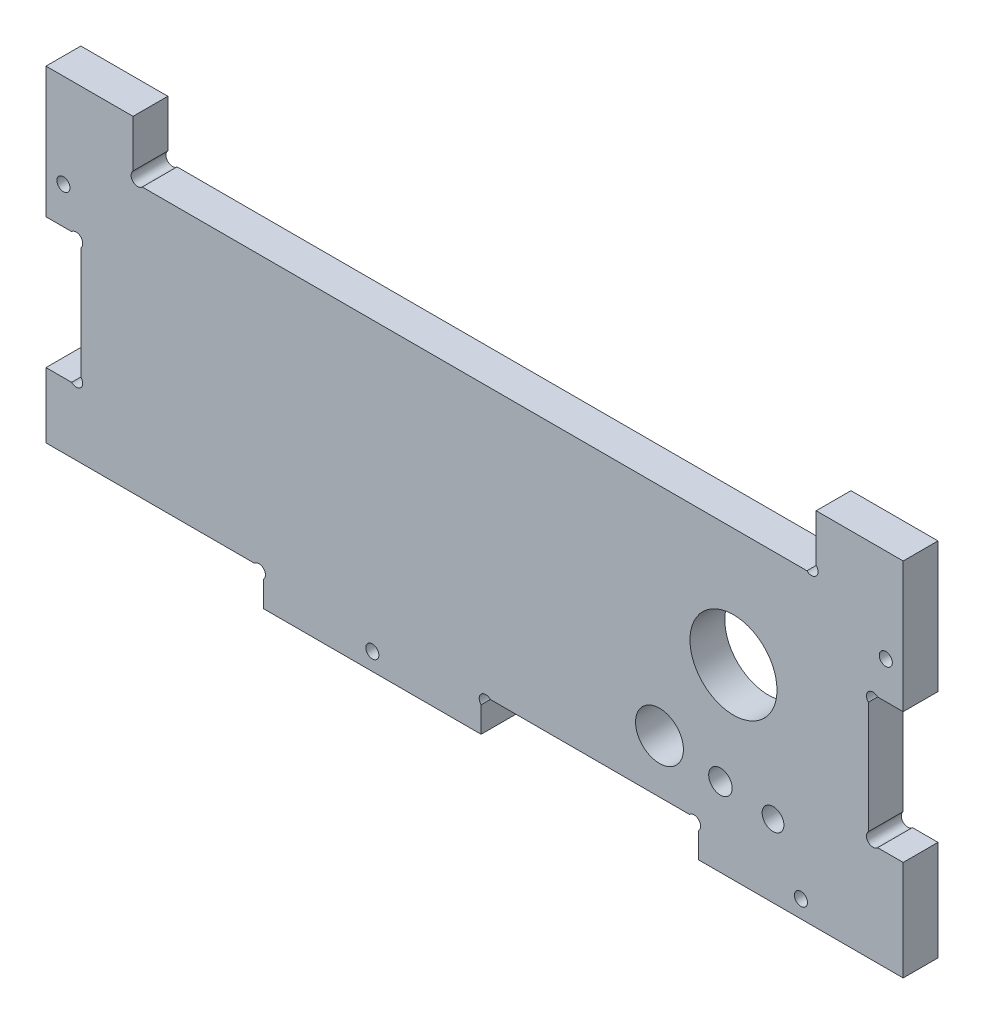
from build123d import *

# Parameters (mm, degrees)
ESQUISSE1_R        = 5.5
ESQUISSE1_R_2      = 2.7
ESQUISSE1_R_3      = 1.500000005
ESQUISSE1_R_4      = 1.499999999
ESQUISSE1_R_5      = 10
ESQUISSE1_R_6      = 1.5
ESQUISSE1_R_7      = 2.5
BOSS_EXTRU_1_DEPTH = 8


with BuildPart() as part:
    # Esquisse1 → Boss.-Extru.1 (new body)
    with BuildSketch(Plane.XY):
        with BuildLine():
            Line((-176.815675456, 28.383111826), (-176.815675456, 45.383111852))
            Line((-176.815675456, 45.383111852), (-176.815675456, 58.383111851))
            Line((-176.815675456, 58.383111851), (-156.815675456, 58.383111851))
            Line((-156.815675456, 58.383111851), (-156.815675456, 47.504432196))
            ThreePointArc((-156.815675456, 47.504432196), (-156.815675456, 45.383111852), (-154.694355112, 45.383111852))
            Line((-154.694355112, 45.383111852), (-118.936995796, 45.383111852))
            Line((-118.936995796, 45.383111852), (-1.936995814, 45.383111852))
            ThreePointArc((-1.936995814, 45.383111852), (0.18432454, 45.383111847), (0.184324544, 47.504432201))
            Line((0.184324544, 47.504432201), (0.184324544, 58.383111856))
            Line((0.184324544, 58.383111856), (20.184324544, 58.383111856))
            Line((20.184324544, 58.383111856), (20.184324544, 45.383111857))
            Line((20.184324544, 45.383111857), (20.184324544, 28.383111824))
            Line((20.184324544, 28.383111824), (14.305644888, 28.383111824))
            ThreePointArc((14.305644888, 28.383111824), (12.184324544, 28.383111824), (12.184324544, 26.26179148))
            Line((12.184324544, 26.26179148), (12.184324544, 0.504432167))
            ThreePointArc((12.184324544, 0.504432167), (12.184324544, -1.616888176), (14.305644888, -1.616888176))
            Line((14.305644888, -1.616888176), (20.184324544, -1.616888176))
            Line((20.184324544, -1.616888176), (20.184324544, -16.616888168))
            Line((20.184324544, -16.616888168), (20.184324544, -24.616888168))
            Line((20.184324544, -24.616888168), (-26.815675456, -24.616888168))
            Line((-26.815675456, -24.616888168), (-26.815675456, -18.738208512))
            ThreePointArc((-26.815675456, -18.738208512), (-26.815675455, -16.616888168), (-28.936995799, -16.616888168))
            Line((-28.936995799, -16.616888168), (-74.694355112, -16.616888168))
            ThreePointArc((-74.694355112, -16.616888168), (-76.815675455, -16.616888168), (-76.815675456, -18.738208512))
            Line((-76.815675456, -18.738208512), (-76.815675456, -24.616888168))
            Line((-76.815675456, -24.616888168), (-126.815675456, -24.616888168))
            Line((-126.815675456, -24.616888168), (-126.815675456, -18.738208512))
            ThreePointArc((-126.815675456, -18.738208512), (-126.815675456, -16.616888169), (-128.936995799, -16.61688817))
            Line((-128.936995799, -16.61688817), (-176.815675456, -16.61688817))
            Line((-176.815675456, -16.61688817), (-176.815675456, -1.616888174))
            Line((-176.815675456, -1.616888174), (-170.936995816, -1.616888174))
            ThreePointArc((-170.936995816, -1.616888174), (-168.815675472, -1.616888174), (-168.815675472, 0.504432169))
            Line((-168.815675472, 0.504432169), (-168.815675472, 26.261791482))
            ThreePointArc((-168.815675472, 26.261791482), (-168.815675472, 28.383111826), (-170.936995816, 28.383111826))
            Line((-170.936995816, 28.383111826), (-176.815675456, 28.383111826))
        make_face()
        with Locations((-35.82431932, -4.416972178)):
            Circle(ESQUISSE1_R, mode=Mode.SUBTRACT)
        with Locations((-21.817975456, -6.516888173)):
            Circle(ESQUISSE1_R_2, mode=Mode.SUBTRACT)
        with Locations((-101.815675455, -20.616888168)):
            Circle(ESQUISSE1_R_3, mode=Mode.SUBTRACT)
        with Locations((-3.315675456, -20.616888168)):
            Circle(ESQUISSE1_R_4, mode=Mode.SUBTRACT)
        with Locations((-18.817975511, 18.195658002)):
            Circle(ESQUISSE1_R_5, mode=Mode.SUBTRACT)
        with Locations((16.184324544, 36.88311184)):
            Circle(ESQUISSE1_R_6, mode=Mode.SUBTRACT)
        with Locations((-9.729073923, -7.925509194)):
            Circle(ESQUISSE1_R_7, mode=Mode.SUBTRACT)
        with Locations((-172.815675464, 36.883111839)):
            Circle(ESQUISSE1_R_6, mode=Mode.SUBTRACT)
    extrude(amount=BOSS_EXTRU_1_DEPTH)


solid = part.part
